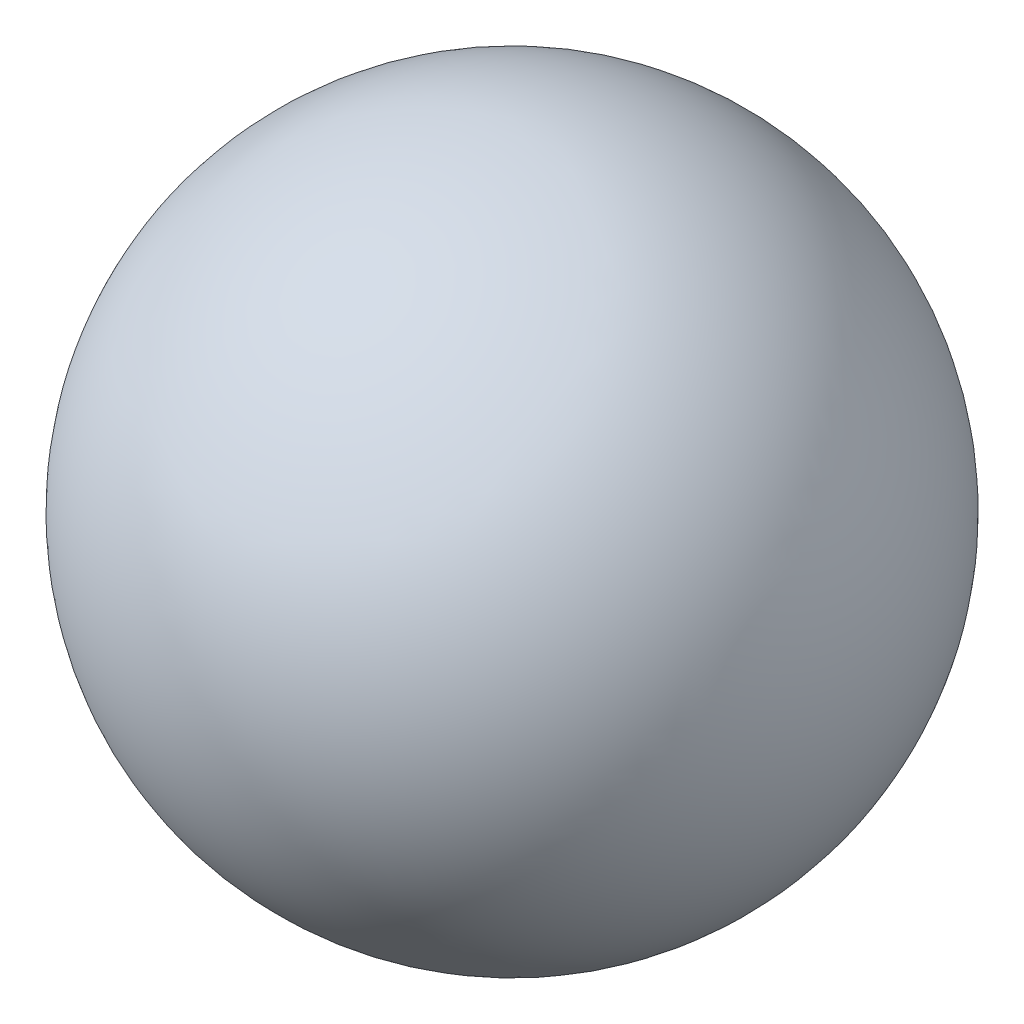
from build123d import *


with BuildPart() as part:
    # Esquisse1 → Base-R_volution (revolve)
    with BuildSketch(Plane(origin=(0, 0, 0), x_dir=(1, 0, 0), z_dir=(0, 1, 0))):
        with BuildLine():
            Line((1.65, 3.95), (6.75, 3.95))
            ThreePointArc((6.75, 3.95), (4.2, 6.5), (1.65, 3.95))
        make_face()
    revolve(axis=Axis((-0.3, 0, -3.95), (1, 0, 0)))


solid = part.part
